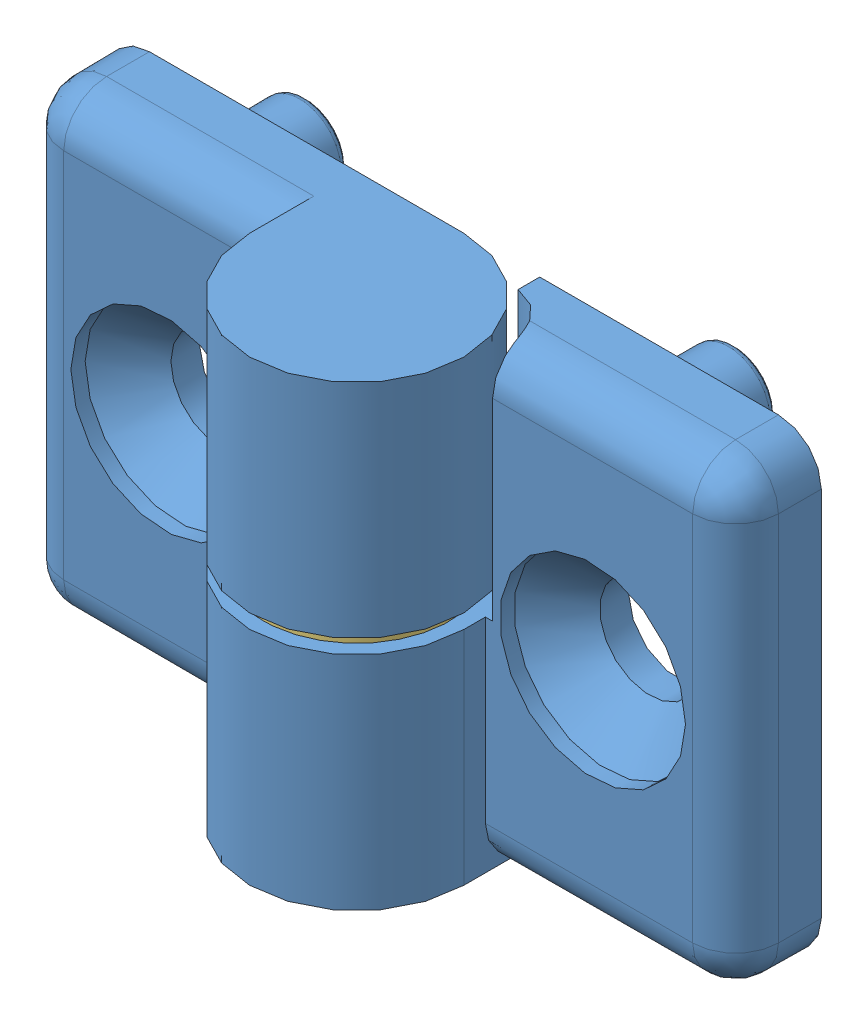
SolidWorks assembly J3PR.SLDASM, configuration Default (file format 7000). Lengths in mm.
Overall size (50 32 19).
4 component instances, 3 part files, 7 mates.
Components (placement in the parent):
- J3PR-1-1: J3PR-1.SLDPRT [ﾃﾞﾌｫﾙﾄ] at origin size (32.5 32 19)
- J3PR-1-2: J3PR-1.SLDPRT [ﾃﾞﾌｫﾙﾄ] at (0 32 0) x (-1 0 0) z (0 0 1) size (32.5 32 19)
- J3PR-2-1: J3PR-2.SLDPRT [Default] at (0 4.65 0) size (6 22.7 6)
- J3PR-3-1: J3PR-3.SLDPRT [Default] at (0 15.5 0) size (13 1 13)
Mates (geometry in assembly coordinates):
- 距離1: distance = 32 mm anti-aligned: plane of J3PR-1-2 through (0 32 0) normal (0 1 0); plane of J3PR-1-1 through (0 0 0) normal (0 -1 0)
- 角度1: planar angle aligned: plane of J3PR-1-2 through (-7.6 16.5 -1.5) normal (0 0 1); plane of J3PR-1-1 through (7.6 15.5 -1.5) normal (0 0 1)
- 同心円1: concentric aligned: cylinder of J3PR-3-1 through (0 16.5 0) axis (0 -1 0) radius 3; cylinder of J3PR-2-1 through (0 27.35 0) axis (0 -1 0) radius 3
- 幅1: width anti-aligned: plane of J3PR-3-1 through (0 16.5 0) normal (0 1 0); plane of J3PR-3-1 through (0 15.5 0) normal (0 -1 0); plane of J3PR-2-1 through (0 4.65 0) normal (0 -1 0); plane of J3PR-2-1 through (0 27.35 0) normal (0 1 0)
- 同心円2: concentric anti-aligned: cylinder of J3PR-1-1 through (0 2 0) axis (0 1 0) radius 3; cylinder of J3PR-1-2 through (0 30 0) axis (0 -1 0) radius 3
- 一致3: coincident anti-aligned: plane of J3PR-1-1 through (0 15.5 0) normal (0 1 0); plane of J3PR-3-1 through (0 15.5 0) normal (0 -1 0)
- 同心円3: concentric aligned: cylinder of J3PR-1-2 through (0 30 0) axis (0 -1 0) radius 3; cylinder of J3PR-2-1 through (0 27.35 0) axis (0 -1 0) radius 3
